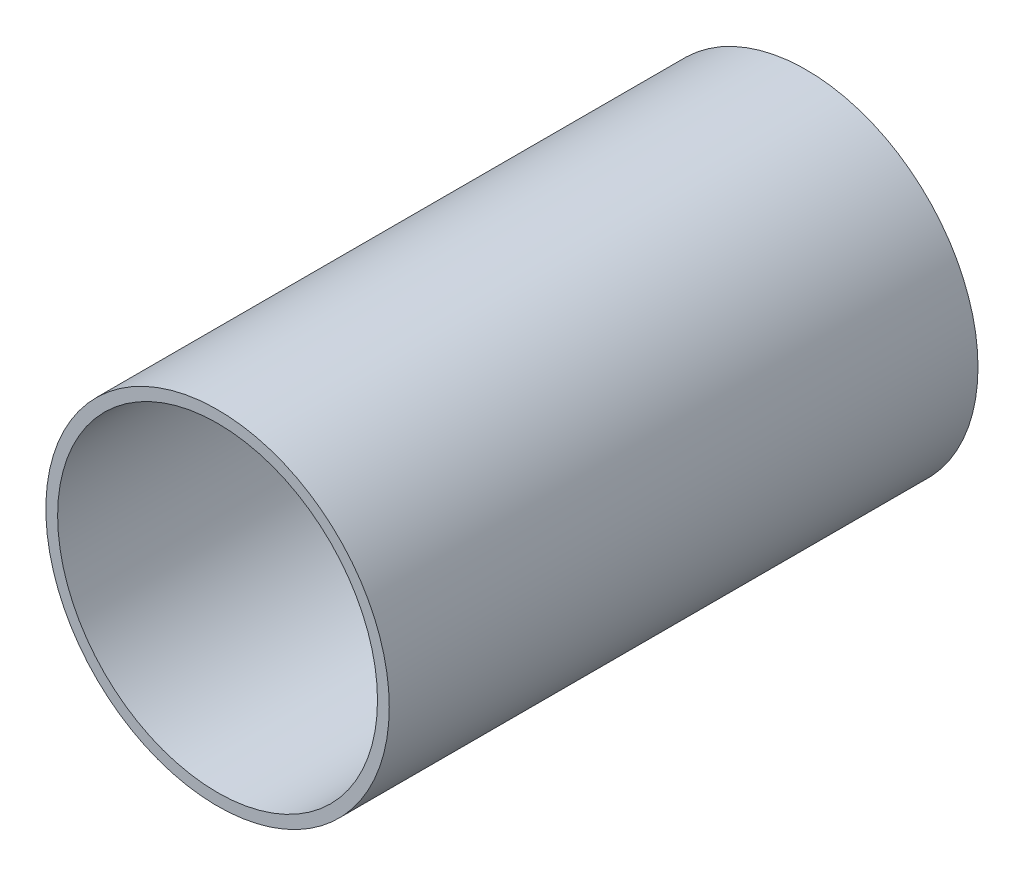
from build123d import *

# Parameters (mm, degrees)
SKETCH1_R           = 44.45
SKETCH1_R_2         = 41.402
BOSS_EXTRUDE1_DEPTH = 152.4


with BuildPart() as part:
    # Sketch1 → Boss-Extrude1 (new body)
    with BuildSketch(Plane.XY):
        Circle(SKETCH1_R)
        Circle(SKETCH1_R_2, mode=Mode.SUBTRACT)
    extrude(amount=-BOSS_EXTRUDE1_DEPTH)


solid = part.part
